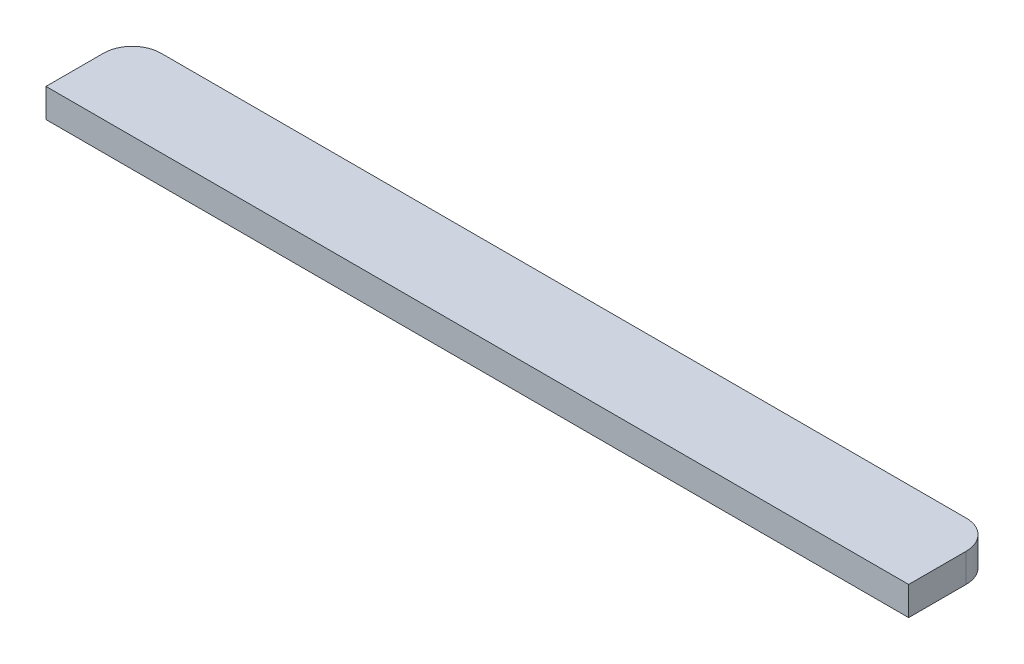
ISO-10303-21;
HEADER;
FILE_DESCRIPTION(('STEP AP214'),'2;1');
FILE_NAME('part.step','',(''),(''),'','','');
FILE_SCHEMA(('AUTOMOTIVE_DESIGN { 1 0 10303 214 1 1 1 1 }'));
ENDSEC;
DATA;
#1=APPLICATION_CONTEXT('core data for automotive mechanical design processes');
#2=APPLICATION_PROTOCOL_DEFINITION('international standard','automotive_design',2000,#1);
#3=PRODUCT_CONTEXT('',#1,'mechanical');
#4=PRODUCT('Part','Part','',(#3));
#5=PRODUCT_RELATED_PRODUCT_CATEGORY('part','',(#4));
#6=PRODUCT_DEFINITION_FORMATION('','',#4);
#7=PRODUCT_DEFINITION_CONTEXT('part definition',#1,'design');
#8=PRODUCT_DEFINITION('design','',#6,#7);
#9=PRODUCT_DEFINITION_SHAPE('','',#8);
#10=(LENGTH_UNIT() NAMED_UNIT(*) SI_UNIT(.MILLI.,.METRE.));
#11=(NAMED_UNIT(*) PLANE_ANGLE_UNIT() SI_UNIT($,.RADIAN.));
#12=(NAMED_UNIT(*) SI_UNIT($,.STERADIAN.) SOLID_ANGLE_UNIT());
#13=UNCERTAINTY_MEASURE_WITH_UNIT(LENGTH_MEASURE(1.E-05),#10,'distance_accuracy_value','');
#14=(GEOMETRIC_REPRESENTATION_CONTEXT(3) GLOBAL_UNCERTAINTY_ASSIGNED_CONTEXT((#13)) GLOBAL_UNIT_ASSIGNED_CONTEXT((#10,
#11,#12)) REPRESENTATION_CONTEXT('',''));
#15=CARTESIAN_POINT('',(0.,0.,0.));
#16=DIRECTION('',(0.,0.,1.));
#17=DIRECTION('',(1.,0.,0.));
#18=AXIS2_PLACEMENT_3D('',#15,#16,#17);
#19=CARTESIAN_POINT('',(0.,0.,-19.05));
#20=DIRECTION('',(-1.,0.,0.));
#21=DIRECTION('',(0.,0.,1.));
#22=AXIS2_PLACEMENT_3D('',#19,#20,#21);
#23=PLANE('',#22);
#24=DIRECTION('',(0.,0.,1.));
#25=VECTOR('',#24,1.);
#26=CARTESIAN_POINT('',(0.,0.,-19.05));
#27=LINE('',#26,#25);
#28=CARTESIAN_POINT('',(0.,0.,-12.7));
#29=VERTEX_POINT('',#28);
#30=CARTESIAN_POINT('',(0.,0.,0.));
#31=VERTEX_POINT('',#30);
#32=EDGE_CURVE('E84',#29,#31,#27,.T.);
#33=ORIENTED_EDGE('',*,*,#32,.F.);
#34=DIRECTION('',(0.,-1.,0.));
#35=VECTOR('',#34,1.);
#36=CARTESIAN_POINT('',(0.,0.,-12.7));
#37=LINE('',#36,#35);
#38=CARTESIAN_POINT('',(0.,6.34999999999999,-12.7));
#39=VERTEX_POINT('',#38);
#40=EDGE_CURVE('E55',#29,#39,#37,.F.);
#41=ORIENTED_EDGE('',*,*,#40,.T.);
#42=DIRECTION('',(0.,0.,1.));
#43=VECTOR('',#42,1.);
#44=CARTESIAN_POINT('',(0.,6.34999999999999,-19.05));
#45=LINE('',#44,#43);
#46=CARTESIAN_POINT('',(0.,6.34999999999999,0.));
#47=VERTEX_POINT('',#46);
#48=EDGE_CURVE('E104',#39,#47,#45,.T.);
#49=ORIENTED_EDGE('',*,*,#48,.T.);
#50=DIRECTION('',(0.,-1.,0.));
#51=VECTOR('',#50,1.);
#52=CARTESIAN_POINT('',(0.,0.,0.));
#53=LINE('',#52,#51);
#54=EDGE_CURVE('E100',#47,#31,#53,.T.);
#55=ORIENTED_EDGE('',*,*,#54,.T.);
#56=EDGE_LOOP('',(#33,#41,#49,#55));
#57=FACE_BOUND('',#56,.T.);
#58=ADVANCED_FACE('F32',(#57),#23,.F.);
#59=CARTESIAN_POINT('',(0.,0.,-19.05));
#60=DIRECTION('',(0.,1.,0.));
#61=DIRECTION('',(0.,0.,1.));
#62=AXIS2_PLACEMENT_3D('',#59,#60,#61);
#63=PLANE('',#62);
#64=DIRECTION('',(-1.,0.,0.));
#65=VECTOR('',#64,1.);
#66=CARTESIAN_POINT('',(0.,0.,-19.05));
#67=LINE('',#66,#65);
#68=CARTESIAN_POINT('',(-6.35,0.,-19.05));
#69=VERTEX_POINT('',#68);
#70=CARTESIAN_POINT('',(-184.15,0.,-19.05));
#71=VERTEX_POINT('',#70);
#72=EDGE_CURVE('E114',#69,#71,#67,.T.);
#73=ORIENTED_EDGE('',*,*,#72,.F.);
#74=CARTESIAN_POINT('',(-6.35,0.,-12.7));
#75=DIRECTION('',(0.,1.,0.));
#76=DIRECTION('',(0.,0.,1.));
#77=AXIS2_PLACEMENT_3D('',#74,#75,#76);
#78=CIRCLE('',#77,6.35);
#79=EDGE_CURVE('E91',#69,#29,#78,.F.);
#80=ORIENTED_EDGE('',*,*,#79,.T.);
#81=ORIENTED_EDGE('',*,*,#32,.T.);
#82=DIRECTION('',(-1.,0.,0.));
#83=VECTOR('',#82,1.);
#84=CARTESIAN_POINT('',(0.,0.,0.));
#85=LINE('',#84,#83);
#86=CARTESIAN_POINT('',(-190.5,0.,0.));
#87=VERTEX_POINT('',#86);
#88=EDGE_CURVE('E89',#31,#87,#85,.T.);
#89=ORIENTED_EDGE('',*,*,#88,.T.);
#90=DIRECTION('',(0.,0.,1.));
#91=VECTOR('',#90,1.);
#92=CARTESIAN_POINT('',(-190.5,0.,-19.05));
#93=LINE('',#92,#91);
#94=CARTESIAN_POINT('',(-190.5,0.,-12.7));
#95=VERTEX_POINT('',#94);
#96=EDGE_CURVE('E94',#95,#87,#93,.T.);
#97=ORIENTED_EDGE('',*,*,#96,.F.);
#98=CARTESIAN_POINT('',(-184.15,0.,-12.7));
#99=DIRECTION('',(0.,1.,0.));
#100=DIRECTION('',(0.,0.,1.));
#101=AXIS2_PLACEMENT_3D('',#98,#99,#100);
#102=CIRCLE('',#101,6.35);
#103=EDGE_CURVE('E124',#95,#71,#102,.F.);
#104=ORIENTED_EDGE('',*,*,#103,.T.);
#105=EDGE_LOOP('',(#73,#80,#81,#89,#97,#104));
#106=FACE_BOUND('',#105,.T.);
#107=ADVANCED_FACE('F87',(#106),#63,.F.);
#108=CARTESIAN_POINT('',(-190.5,0.,-19.05));
#109=DIRECTION('',(1.,0.,0.));
#110=DIRECTION('',(0.,0.,-1.));
#111=AXIS2_PLACEMENT_3D('',#108,#109,#110);
#112=PLANE('',#111);
#113=DIRECTION('',(0.,0.,1.));
#114=VECTOR('',#113,1.);
#115=CARTESIAN_POINT('',(-190.5,6.34999999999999,-19.05));
#116=LINE('',#115,#114);
#117=CARTESIAN_POINT('',(-190.5,6.34999999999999,-12.7));
#118=VERTEX_POINT('',#117);
#119=CARTESIAN_POINT('',(-190.5,6.34999999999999,0.));
#120=VERTEX_POINT('',#119);
#121=EDGE_CURVE('E116',#118,#120,#116,.T.);
#122=ORIENTED_EDGE('',*,*,#121,.F.);
#123=DIRECTION('',(0.,1.,0.));
#124=VECTOR('',#123,1.);
#125=CARTESIAN_POINT('',(-190.5,0.,-12.7));
#126=LINE('',#125,#124);
#127=EDGE_CURVE('E11',#118,#95,#126,.F.);
#128=ORIENTED_EDGE('',*,*,#127,.T.);
#129=ORIENTED_EDGE('',*,*,#96,.T.);
#130=DIRECTION('',(0.,1.,0.));
#131=VECTOR('',#130,1.);
#132=CARTESIAN_POINT('',(-190.5,0.,0.));
#133=LINE('',#132,#131);
#134=EDGE_CURVE('E102',#87,#120,#133,.T.);
#135=ORIENTED_EDGE('',*,*,#134,.T.);
#136=EDGE_LOOP('',(#122,#128,#129,#135));
#137=FACE_BOUND('',#136,.T.);
#138=ADVANCED_FACE('F150',(#137),#112,.F.);
#139=CARTESIAN_POINT('',(0.,6.34999999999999,-19.05));
#140=DIRECTION('',(0.,-1.,0.));
#141=DIRECTION('',(0.,0.,-1.));
#142=AXIS2_PLACEMENT_3D('',#139,#140,#141);
#143=PLANE('',#142);
#144=ORIENTED_EDGE('',*,*,#48,.F.);
#145=CARTESIAN_POINT('',(-6.35,6.34999999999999,-12.7));
#146=DIRECTION('',(0.,-1.,0.));
#147=DIRECTION('',(0.,0.,-1.));
#148=AXIS2_PLACEMENT_3D('',#145,#146,#147);
#149=CIRCLE('',#148,6.35);
#150=CARTESIAN_POINT('',(-6.35,6.34999999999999,-19.05));
#151=VERTEX_POINT('',#150);
#152=EDGE_CURVE('E40',#39,#151,#149,.F.);
#153=ORIENTED_EDGE('',*,*,#152,.T.);
#154=DIRECTION('',(1.,0.,0.));
#155=VECTOR('',#154,1.);
#156=CARTESIAN_POINT('',(0.,6.34999999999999,-19.05));
#157=LINE('',#156,#155);
#158=CARTESIAN_POINT('',(-184.15,6.34999999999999,-19.05));
#159=VERTEX_POINT('',#158);
#160=EDGE_CURVE('E108',#159,#151,#157,.T.);
#161=ORIENTED_EDGE('',*,*,#160,.F.);
#162=CARTESIAN_POINT('',(-184.15,6.34999999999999,-12.7));
#163=DIRECTION('',(0.,-1.,0.));
#164=DIRECTION('',(0.,0.,-1.));
#165=AXIS2_PLACEMENT_3D('',#162,#163,#164);
#166=CIRCLE('',#165,6.35);
#167=EDGE_CURVE('E47',#159,#118,#166,.F.);
#168=ORIENTED_EDGE('',*,*,#167,.T.);
#169=ORIENTED_EDGE('',*,*,#121,.T.);
#170=DIRECTION('',(1.,0.,0.));
#171=VECTOR('',#170,1.);
#172=CARTESIAN_POINT('',(0.,6.34999999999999,0.));
#173=LINE('',#172,#171);
#174=EDGE_CURVE('E112',#120,#47,#173,.T.);
#175=ORIENTED_EDGE('',*,*,#174,.T.);
#176=EDGE_LOOP('',(#144,#153,#161,#168,#169,#175));
#177=FACE_BOUND('',#176,.T.);
#178=ADVANCED_FACE('F130',(#177),#143,.F.);
#179=CARTESIAN_POINT('',(0.,6.34999999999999,-19.05));
#180=DIRECTION('',(0.,0.,1.));
#181=DIRECTION('',(1.,0.,0.));
#182=AXIS2_PLACEMENT_3D('',#179,#180,#181);
#183=PLANE('',#182);
#184=ORIENTED_EDGE('',*,*,#160,.T.);
#185=DIRECTION('',(0.,-1.,0.));
#186=VECTOR('',#185,1.);
#187=CARTESIAN_POINT('',(-6.35,6.34999999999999,-19.05));
#188=LINE('',#187,#186);
#189=EDGE_CURVE('E121',#151,#69,#188,.T.);
#190=ORIENTED_EDGE('',*,*,#189,.T.);
#191=ORIENTED_EDGE('',*,*,#72,.T.);
#192=DIRECTION('',(0.,1.,0.));
#193=VECTOR('',#192,1.);
#194=CARTESIAN_POINT('',(-184.15,6.34999999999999,-19.05));
#195=LINE('',#194,#193);
#196=EDGE_CURVE('E93',#71,#159,#195,.T.);
#197=ORIENTED_EDGE('',*,*,#196,.T.);
#198=EDGE_LOOP('',(#184,#190,#191,#197));
#199=FACE_BOUND('',#198,.T.);
#200=ADVANCED_FACE('F134',(#199),#183,.F.);
#201=CARTESIAN_POINT('',(0.,6.34999999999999,0.));
#202=DIRECTION('',(0.,0.,1.));
#203=DIRECTION('',(1.,0.,0.));
#204=AXIS2_PLACEMENT_3D('',#201,#202,#203);
#205=PLANE('',#204);
#206=ORIENTED_EDGE('',*,*,#54,.F.);
#207=ORIENTED_EDGE('',*,*,#174,.F.);
#208=ORIENTED_EDGE('',*,*,#134,.F.);
#209=ORIENTED_EDGE('',*,*,#88,.F.);
#210=EDGE_LOOP('',(#206,#207,#208,#209));
#211=FACE_BOUND('',#210,.T.);
#212=ADVANCED_FACE('F98',(#211),#205,.T.);
#213=CARTESIAN_POINT('',(-6.35,6.34999999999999,-12.7));
#214=DIRECTION('',(0.,-1.,0.));
#215=DIRECTION('',(0.,0.,-1.));
#216=AXIS2_PLACEMENT_3D('',#213,#214,#215);
#217=CYLINDRICAL_SURFACE('',#216,6.35);
#218=ORIENTED_EDGE('',*,*,#152,.F.);
#219=ORIENTED_EDGE('',*,*,#40,.F.);
#220=ORIENTED_EDGE('',*,*,#79,.F.);
#221=ORIENTED_EDGE('',*,*,#189,.F.);
#222=EDGE_LOOP('',(#218,#219,#220,#221));
#223=FACE_BOUND('',#222,.T.);
#224=ADVANCED_FACE('F137',(#223),#217,.T.);
#225=CARTESIAN_POINT('',(-184.15,6.34999999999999,-12.7));
#226=DIRECTION('',(0.,1.,0.));
#227=DIRECTION('',(0.,0.,1.));
#228=AXIS2_PLACEMENT_3D('',#225,#226,#227);
#229=CYLINDRICAL_SURFACE('',#228,6.35);
#230=ORIENTED_EDGE('',*,*,#103,.F.);
#231=ORIENTED_EDGE('',*,*,#127,.F.);
#232=ORIENTED_EDGE('',*,*,#167,.F.);
#233=ORIENTED_EDGE('',*,*,#196,.F.);
#234=EDGE_LOOP('',(#230,#231,#232,#233));
#235=FACE_BOUND('',#234,.T.);
#236=ADVANCED_FACE('F34',(#235),#229,.T.);
#237=CLOSED_SHELL('',(#58,#107,#138,#178,#200,#212,#224,#236));
#238=MANIFOLD_SOLID_BREP('B2',#237);
#239=ADVANCED_BREP_SHAPE_REPRESENTATION('',(#18,#238),#14);
#240=SHAPE_DEFINITION_REPRESENTATION(#9,#239);
ENDSEC;
END-ISO-10303-21;
